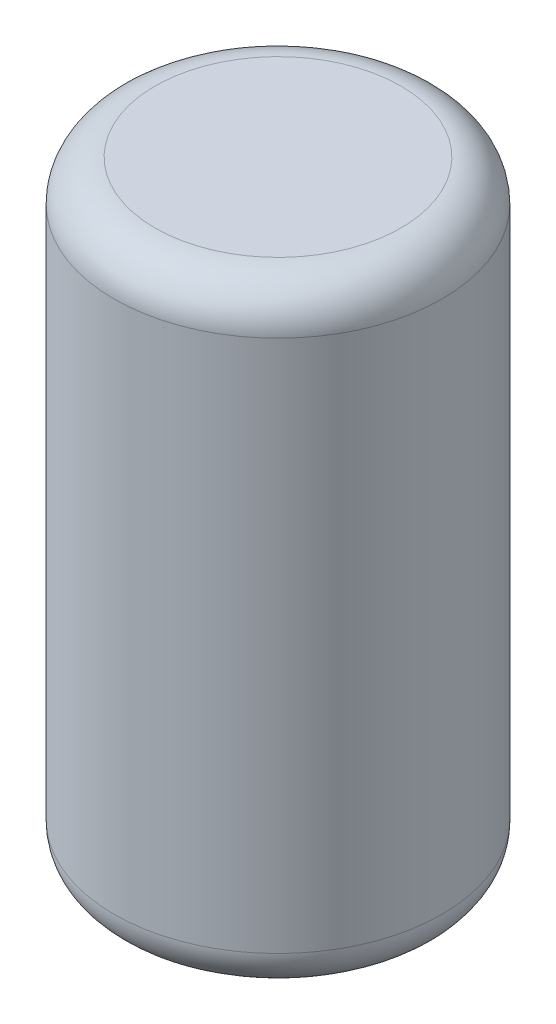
from build123d import *

# Parameters (mm, degrees)
SKETCH1_R           = 4
BOSS_EXTRUDE1_DEPTH = 15
FILLET1_R           = 1


with BuildPart() as part:
    # Sketch1 → Boss-Extrude1 (new body)
    with BuildSketch(Plane(origin=(0, 0, 0), x_dir=(1, 0, 0), z_dir=(0, 1, 0))):
        with Locations(Location((0, 0, 0), (0, 0, 270))):
            Circle(SKETCH1_R)
    extrude(amount=BOSS_EXTRUDE1_DEPTH)

    # Fillet1
    fillet1_edges = [part.edges().sort_by_distance(p)[0] for p in [
        (0, 0, -4),
        (0, 15, -4),
    ]]
    fillet(fillet1_edges, radius=FILLET1_R)


solid = part.part
